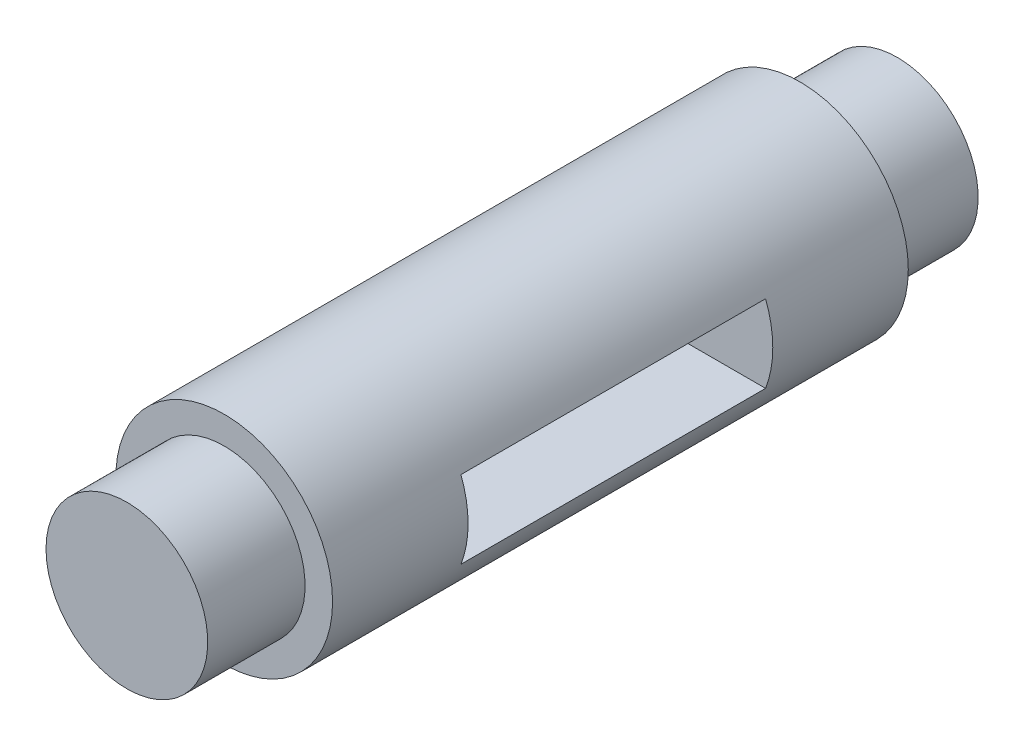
from build123d import *

# Parameters (mm, degrees)
SKETCH1_R           = 4.2545
SKETCH1_R_2         = 3.175
BOSS_EXTRUDE1_DEPTH = 11.303
SKETCH2_R           = 3.175
BOSS_EXTRUDE2_DEPTH = 15.1257
SKETCH5_W           = 5.9817
SKETCH5_H           = 3.048
CUT_EXTRUDE2_DEPTH  = 15.1257


with BuildPart() as part:
    # Sketch1 → Boss-Extrude1 (new, symmetric)
    with BuildSketch(Plane.XY):
        with Locations(Location((0, 0, 0), (0, 0, 180))):
            Circle(SKETCH1_R)
        with Locations(Location((0, 0, 0), (0, 0, 180))):
            Circle(SKETCH1_R_2, mode=Mode.SUBTRACT)
    extrude(amount=BOSS_EXTRUDE1_DEPTH, both=True)

    # Sketch2 → Boss-Extrude2 (add, symmetric)
    with BuildSketch(Plane.XY):
        with Locations(Location((0, 0, 0), (0, 0, 180))):
            Circle(SKETCH2_R)
    extrude(amount=BOSS_EXTRUDE2_DEPTH, both=True)

    # Sketch5 → Cut-Extrude2 (cut, symmetric)
    with BuildSketch(Plane(origin=(0, 0, 0), x_dir=(0, 0, -1), z_dir=(1, 0, 0))):
        with Locations((-2.99085, 0)):
            Rectangle(SKETCH5_W, SKETCH5_H)
        with Locations((2.99085, 0)):
            Rectangle(SKETCH5_W, SKETCH5_H)
    extrude(amount=CUT_EXTRUDE2_DEPTH, both=True, mode=Mode.SUBTRACT)


solid = part.part
